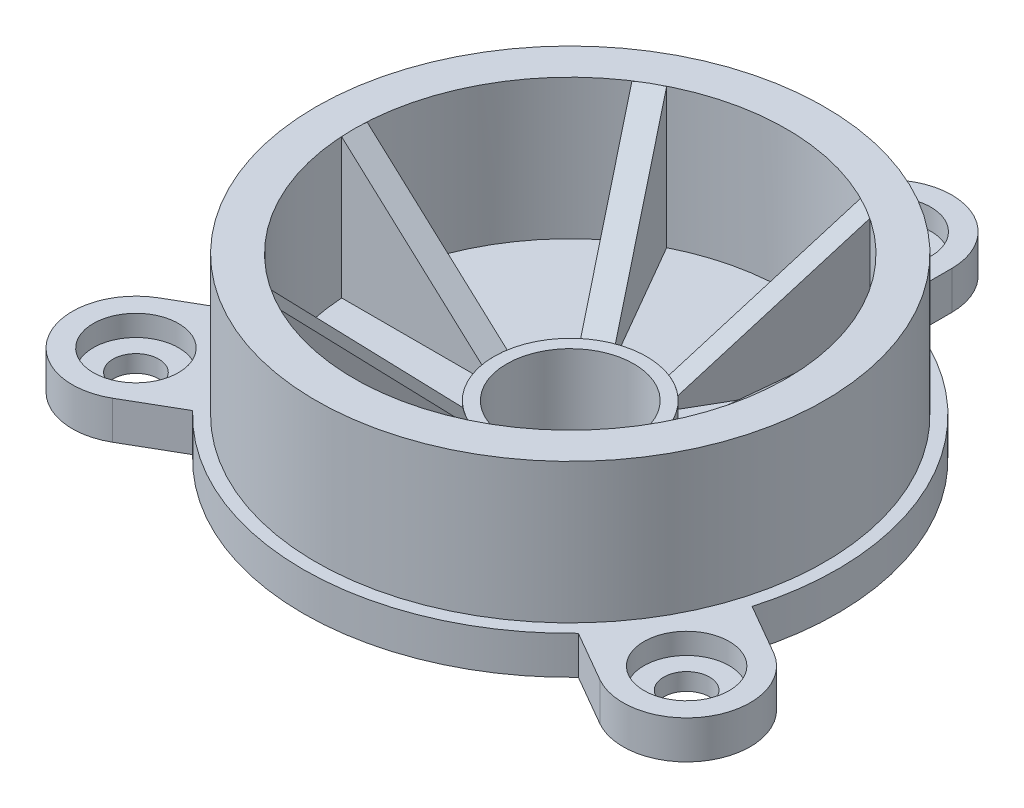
from build123d import *

# Parameters (mm, degrees)
EXTRUDE1_START                  = -3
EXTRUDE1_DEPTH                  = 3
CBORE_FOR_M3_SBHCS1_D           = 3.6
CBORE_FOR_M3_SBHCS1_CBORE_D     = 6.7
CBORE_FOR_M3_SBHCS1_CBORE_DEPTH = 1.65
CIRPATTERN1_COUNT               = 3
RIB1_REACH                      = 45.2
SKETCH5_WALL_W                  = 103.26644724
SKETCH5_WALL_H                  = 2
CIRPATTERN2_COUNT               = 6


with BuildPart() as part:
    # Sketch1 → Revolve1 (revolve)
    with BuildSketch(Plane.XY, mode=Mode.PRIVATE) as revolve1_sk:
        Polygon((17, 16), (20, 16), (20, 5), (21, 5), (21, 2), (10, 2), (10, 0), (5, 0), (5, 6), (6, 6), (6, 5), (17, 5), align=None)
    revolve(revolve1_sk.sketch.rotate(Axis((0, 69.756492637, 0), (0, -1, 0)), 180), axis=Axis((0, 69.756492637, 0), (0, -1, 0)))

    # Sketch2 → Extrude1 (add)
    with BuildSketch(Plane(origin=(0, 5, 0), x_dir=(-1, 0, 0), z_dir=(0, 1, 0)).offset(EXTRUDE1_START)):
        with BuildLine():
            Line((5, -25), (5, -20.396078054))
            ThreePointArc((5, -20.396078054), (0, -21), (-5, -20.396078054))
            Line((-5, -20.396078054), (-5, -25))
            ThreePointArc((-5, -25), (0, -30), (5, -25))
        make_face()
    extrude1 = extrude(amount=EXTRUDE1_DEPTH)

    # CBORE for M3 SBHCS1 (through all)
    with Locations(Plane(origin=(0, 5, 0), x_dir=(-1, 0, 0), z_dir=(0, 1, 0))):
        with Locations((0, -25)):
            cbore_for_m3_sbhcs1 = CounterBoreHole(CBORE_FOR_M3_SBHCS1_D / 2, CBORE_FOR_M3_SBHCS1_CBORE_D / 2, CBORE_FOR_M3_SBHCS1_CBORE_DEPTH)

    # CirPattern1: Extrude1, CBORE for M3 SBHCS1 ×3 about axis
    cirpattern1_axis = Axis((0, 0, 0), (0, 1, 0))
    add([extrude1.rotate(cirpattern1_axis, i * 360 / CIRPATTERN1_COUNT) for i in range(1, CIRPATTERN1_COUNT)])
    add([cbore_for_m3_sbhcs1.rotate(cirpattern1_axis, i * 360 / CIRPATTERN1_COUNT) for i in range(1, CIRPATTERN1_COUNT)], mode=Mode.SUBTRACT)

    # Sketch5 wall → Rib1 (add, up to next)
    with BuildSketch(Plane(origin=(-11.5, 11, 0), x_dir=(0.739940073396, -0.672672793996, 0), z_dir=(0.672672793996, 0.739940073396, 0)), mode=Mode.PRIVATE) as rib1_sk1:
        Rectangle(SKETCH5_WALL_W, SKETCH5_WALL_H)
    rib1_tool1 = extrude(rib1_sk1.sketch, amount=-RIB1_REACH, mode=Mode.PRIVATE) - part.part
    rib1 = rib1_tool1.solids().sort_by_distance((-11.5, 11, 0))[0]
    add(rib1)

    # CirPattern2: Rib1 ×6 about axis
    cirpattern2_axis = Axis((0, 0, 0), (0, 1, 0))
    for i in range(1, CIRPATTERN2_COUNT):
        add(rib1.rotate(cirpattern2_axis, i * 360 / CIRPATTERN2_COUNT))


solid = part.part
